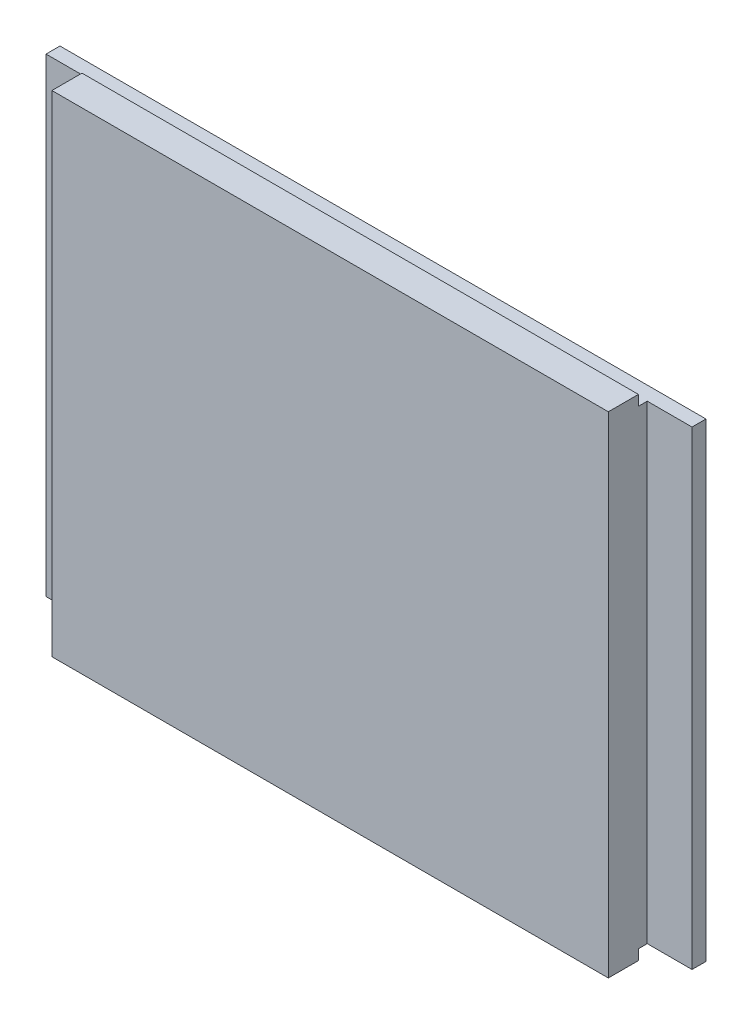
ISO-10303-21;
HEADER;
FILE_DESCRIPTION(('STEP AP214'),'2;1');
FILE_NAME('part.step','',(''),(''),'','','');
FILE_SCHEMA(('AUTOMOTIVE_DESIGN { 1 0 10303 214 1 1 1 1 }'));
ENDSEC;
DATA;
#1=APPLICATION_CONTEXT('core data for automotive mechanical design processes');
#2=APPLICATION_PROTOCOL_DEFINITION('international standard','automotive_design',2000,#1);
#3=PRODUCT_CONTEXT('',#1,'mechanical');
#4=PRODUCT('Part','Part','',(#3));
#5=PRODUCT_RELATED_PRODUCT_CATEGORY('part','',(#4));
#6=PRODUCT_DEFINITION_FORMATION('','',#4);
#7=PRODUCT_DEFINITION_CONTEXT('part definition',#1,'design');
#8=PRODUCT_DEFINITION('design','',#6,#7);
#9=PRODUCT_DEFINITION_SHAPE('','',#8);
#10=(LENGTH_UNIT() NAMED_UNIT(*) SI_UNIT(.MILLI.,.METRE.));
#11=(NAMED_UNIT(*) PLANE_ANGLE_UNIT() SI_UNIT($,.RADIAN.));
#12=(NAMED_UNIT(*) SI_UNIT($,.STERADIAN.) SOLID_ANGLE_UNIT());
#13=UNCERTAINTY_MEASURE_WITH_UNIT(LENGTH_MEASURE(1.E-05),#10,'distance_accuracy_value','');
#14=(GEOMETRIC_REPRESENTATION_CONTEXT(3) GLOBAL_UNCERTAINTY_ASSIGNED_CONTEXT((#13)) GLOBAL_UNIT_ASSIGNED_CONTEXT((#10,
#11,#12)) REPRESENTATION_CONTEXT('',''));
#15=CARTESIAN_POINT('',(0.,0.,0.));
#16=DIRECTION('',(0.,0.,1.));
#17=DIRECTION('',(1.,0.,0.));
#18=AXIS2_PLACEMENT_3D('',#15,#16,#17);
#19=CARTESIAN_POINT('',(-110.,80.,18.));
#20=DIRECTION('',(0.,-1.,0.));
#21=DIRECTION('',(0.,0.,-1.));
#22=AXIS2_PLACEMENT_3D('',#19,#20,#21);
#23=PLANE('',#22);
#24=DIRECTION('',(-1.,0.,0.));
#25=VECTOR('',#24,1.);
#26=CARTESIAN_POINT('',(-110.,80.,7.75));
#27=LINE('',#26,#25);
#28=CARTESIAN_POINT('',(94.75,80.,7.75));
#29=VERTEX_POINT('',#28);
#30=CARTESIAN_POINT('',(-94.75,80.,7.75));
#31=VERTEX_POINT('',#30);
#32=EDGE_CURVE('E59',#29,#31,#27,.T.);
#33=ORIENTED_EDGE('',*,*,#32,.F.);
#34=DIRECTION('',(0.,0.,1.));
#35=VECTOR('',#34,1.);
#36=CARTESIAN_POINT('',(94.75,80.,4.75));
#37=LINE('',#36,#35);
#38=CARTESIAN_POINT('',(94.75,80.,4.75));
#39=VERTEX_POINT('',#38);
#40=EDGE_CURVE('E204',#39,#29,#37,.T.);
#41=ORIENTED_EDGE('',*,*,#40,.F.);
#42=DIRECTION('',(-1.,0.,0.));
#43=VECTOR('',#42,1.);
#44=CARTESIAN_POINT('',(0.,80.,4.75));
#45=LINE('',#44,#43);
#46=CARTESIAN_POINT('',(110.,80.,4.75));
#47=VERTEX_POINT('',#46);
#48=EDGE_CURVE('E221',#47,#39,#45,.T.);
#49=ORIENTED_EDGE('',*,*,#48,.F.);
#50=DIRECTION('',(0.,0.,-1.));
#51=VECTOR('',#50,1.);
#52=CARTESIAN_POINT('',(110.,80.,18.));
#53=LINE('',#52,#51);
#54=CARTESIAN_POINT('',(110.,80.,0.));
#55=VERTEX_POINT('',#54);
#56=EDGE_CURVE('E11',#47,#55,#53,.T.);
#57=ORIENTED_EDGE('',*,*,#56,.T.);
#58=DIRECTION('',(-1.,0.,0.));
#59=VECTOR('',#58,1.);
#60=CARTESIAN_POINT('',(-110.,80.,0.));
#61=LINE('',#60,#59);
#62=CARTESIAN_POINT('',(-110.,80.,0.));
#63=VERTEX_POINT('',#62);
#64=EDGE_CURVE('E236',#55,#63,#61,.T.);
#65=ORIENTED_EDGE('',*,*,#64,.T.);
#66=DIRECTION('',(0.,0.,-1.));
#67=VECTOR('',#66,1.);
#68=CARTESIAN_POINT('',(-110.,80.,18.));
#69=LINE('',#68,#67);
#70=CARTESIAN_POINT('',(-110.,80.,4.75));
#71=VERTEX_POINT('',#70);
#72=EDGE_CURVE('E52',#71,#63,#69,.T.);
#73=ORIENTED_EDGE('',*,*,#72,.F.);
#74=DIRECTION('',(-1.,0.,0.));
#75=VECTOR('',#74,1.);
#76=CARTESIAN_POINT('',(0.,80.,4.75));
#77=LINE('',#76,#75);
#78=CARTESIAN_POINT('',(-94.75,80.,4.75));
#79=VERTEX_POINT('',#78);
#80=EDGE_CURVE('E192',#79,#71,#77,.T.);
#81=ORIENTED_EDGE('',*,*,#80,.F.);
#82=DIRECTION('',(0.,0.,1.));
#83=VECTOR('',#82,1.);
#84=CARTESIAN_POINT('',(-94.75,80.,4.75));
#85=LINE('',#84,#83);
#86=EDGE_CURVE('E64',#79,#31,#85,.T.);
#87=ORIENTED_EDGE('',*,*,#86,.T.);
#88=EDGE_LOOP('',(#33,#41,#49,#57,#65,#73,#81,#87));
#89=FACE_BOUND('',#88,.T.);
#90=ADVANCED_FACE('F43',(#89),#23,.F.);
#91=CARTESIAN_POINT('',(-110.,-80.,18.));
#92=DIRECTION('',(0.,1.,0.));
#93=DIRECTION('',(0.,0.,1.));
#94=AXIS2_PLACEMENT_3D('',#91,#92,#93);
#95=PLANE('',#94);
#96=DIRECTION('',(1.,0.,0.));
#97=VECTOR('',#96,1.);
#98=CARTESIAN_POINT('',(-110.,-80.,7.75));
#99=LINE('',#98,#97);
#100=CARTESIAN_POINT('',(-94.75,-80.,7.75));
#101=VERTEX_POINT('',#100);
#102=CARTESIAN_POINT('',(94.75,-80.,7.75));
#103=VERTEX_POINT('',#102);
#104=EDGE_CURVE('E180',#101,#103,#99,.T.);
#105=ORIENTED_EDGE('',*,*,#104,.F.);
#106=DIRECTION('',(0.,0.,1.));
#107=VECTOR('',#106,1.);
#108=CARTESIAN_POINT('',(-94.75,-80.,4.75));
#109=LINE('',#108,#107);
#110=CARTESIAN_POINT('',(-94.75,-80.,4.75));
#111=VERTEX_POINT('',#110);
#112=EDGE_CURVE('E205',#111,#101,#109,.T.);
#113=ORIENTED_EDGE('',*,*,#112,.F.);
#114=DIRECTION('',(1.,0.,0.));
#115=VECTOR('',#114,1.);
#116=CARTESIAN_POINT('',(0.,-80.,4.75));
#117=LINE('',#116,#115);
#118=CARTESIAN_POINT('',(-110.,-80.,4.75));
#119=VERTEX_POINT('',#118);
#120=EDGE_CURVE('E198',#119,#111,#117,.T.);
#121=ORIENTED_EDGE('',*,*,#120,.F.);
#122=DIRECTION('',(0.,0.,-1.));
#123=VECTOR('',#122,1.);
#124=CARTESIAN_POINT('',(-110.,-80.,18.));
#125=LINE('',#124,#123);
#126=CARTESIAN_POINT('',(-110.,-80.,0.));
#127=VERTEX_POINT('',#126);
#128=EDGE_CURVE('E251',#119,#127,#125,.T.);
#129=ORIENTED_EDGE('',*,*,#128,.T.);
#130=DIRECTION('',(1.,0.,0.));
#131=VECTOR('',#130,1.);
#132=CARTESIAN_POINT('',(-110.,-80.,0.));
#133=LINE('',#132,#131);
#134=CARTESIAN_POINT('',(110.,-80.,0.));
#135=VERTEX_POINT('',#134);
#136=EDGE_CURVE('E244',#127,#135,#133,.T.);
#137=ORIENTED_EDGE('',*,*,#136,.T.);
#138=DIRECTION('',(0.,0.,-1.));
#139=VECTOR('',#138,1.);
#140=CARTESIAN_POINT('',(110.,-80.,18.));
#141=LINE('',#140,#139);
#142=CARTESIAN_POINT('',(110.,-80.,4.75));
#143=VERTEX_POINT('',#142);
#144=EDGE_CURVE('E248',#143,#135,#141,.T.);
#145=ORIENTED_EDGE('',*,*,#144,.F.);
#146=DIRECTION('',(1.,0.,0.));
#147=VECTOR('',#146,1.);
#148=CARTESIAN_POINT('',(0.,-80.,4.75));
#149=LINE('',#148,#147);
#150=CARTESIAN_POINT('',(94.75,-80.,4.75));
#151=VERTEX_POINT('',#150);
#152=EDGE_CURVE('E215',#151,#143,#149,.T.);
#153=ORIENTED_EDGE('',*,*,#152,.F.);
#154=DIRECTION('',(0.,0.,1.));
#155=VECTOR('',#154,1.);
#156=CARTESIAN_POINT('',(94.75,-80.,4.75));
#157=LINE('',#156,#155);
#158=EDGE_CURVE('E225',#151,#103,#157,.T.);
#159=ORIENTED_EDGE('',*,*,#158,.T.);
#160=EDGE_LOOP('',(#105,#113,#121,#129,#137,#145,#153,#159));
#161=FACE_BOUND('',#160,.T.);
#162=ADVANCED_FACE('F270',(#161),#95,.F.);
#163=CARTESIAN_POINT('',(110.,-80.,18.));
#164=DIRECTION('',(-1.,0.,0.));
#165=DIRECTION('',(0.,0.,1.));
#166=AXIS2_PLACEMENT_3D('',#163,#164,#165);
#167=PLANE('',#166);
#168=DIRECTION('',(0.,1.,0.));
#169=VECTOR('',#168,1.);
#170=CARTESIAN_POINT('',(110.,0.,4.75));
#171=LINE('',#170,#169);
#172=EDGE_CURVE('E218',#143,#47,#171,.T.);
#173=ORIENTED_EDGE('',*,*,#172,.F.);
#174=ORIENTED_EDGE('',*,*,#144,.T.);
#175=DIRECTION('',(0.,1.,0.));
#176=VECTOR('',#175,1.);
#177=CARTESIAN_POINT('',(110.,-80.,0.));
#178=LINE('',#177,#176);
#179=EDGE_CURVE('E209',#135,#55,#178,.T.);
#180=ORIENTED_EDGE('',*,*,#179,.T.);
#181=ORIENTED_EDGE('',*,*,#56,.F.);
#182=EDGE_LOOP('',(#173,#174,#180,#181));
#183=FACE_BOUND('',#182,.T.);
#184=ADVANCED_FACE('F45',(#183),#167,.F.);
#185=CARTESIAN_POINT('',(-110.,-80.,18.));
#186=DIRECTION('',(1.,0.,0.));
#187=DIRECTION('',(0.,0.,-1.));
#188=AXIS2_PLACEMENT_3D('',#185,#186,#187);
#189=PLANE('',#188);
#190=DIRECTION('',(0.,-1.,0.));
#191=VECTOR('',#190,1.);
#192=CARTESIAN_POINT('',(-110.,0.,4.75));
#193=LINE('',#192,#191);
#194=EDGE_CURVE('E195',#71,#119,#193,.T.);
#195=ORIENTED_EDGE('',*,*,#194,.F.);
#196=ORIENTED_EDGE('',*,*,#72,.T.);
#197=DIRECTION('',(0.,-1.,0.));
#198=VECTOR('',#197,1.);
#199=CARTESIAN_POINT('',(-110.,-80.,0.));
#200=LINE('',#199,#198);
#201=EDGE_CURVE('E240',#63,#127,#200,.T.);
#202=ORIENTED_EDGE('',*,*,#201,.T.);
#203=ORIENTED_EDGE('',*,*,#128,.F.);
#204=EDGE_LOOP('',(#195,#196,#202,#203));
#205=FACE_BOUND('',#204,.T.);
#206=ADVANCED_FACE('F257',(#205),#189,.F.);
#207=CARTESIAN_POINT('',(0.,0.,18.));
#208=DIRECTION('',(0.,0.,-1.));
#209=DIRECTION('',(-1.,0.,0.));
#210=AXIS2_PLACEMENT_3D('',#207,#208,#209);
#211=PLANE('',#210);
#212=DIRECTION('',(0.,-1.,0.));
#213=VECTOR('',#212,1.);
#214=CARTESIAN_POINT('',(-94.75,0.,18.));
#215=LINE('',#214,#213);
#216=CARTESIAN_POINT('',(-94.75,83.5,18.));
#217=VERTEX_POINT('',#216);
#218=CARTESIAN_POINT('',(-94.75,-83.5,18.));
#219=VERTEX_POINT('',#218);
#220=EDGE_CURVE('E146',#217,#219,#215,.T.);
#221=ORIENTED_EDGE('',*,*,#220,.T.);
#222=DIRECTION('',(1.,0.,0.));
#223=VECTOR('',#222,1.);
#224=CARTESIAN_POINT('',(0.,-83.5,18.));
#225=LINE('',#224,#223);
#226=CARTESIAN_POINT('',(94.75,-83.5,18.));
#227=VERTEX_POINT('',#226);
#228=EDGE_CURVE('E170',#219,#227,#225,.T.);
#229=ORIENTED_EDGE('',*,*,#228,.T.);
#230=DIRECTION('',(0.,1.,0.));
#231=VECTOR('',#230,1.);
#232=CARTESIAN_POINT('',(94.75,0.,18.));
#233=LINE('',#232,#231);
#234=CARTESIAN_POINT('',(94.75,83.5,18.));
#235=VERTEX_POINT('',#234);
#236=EDGE_CURVE('E188',#227,#235,#233,.T.);
#237=ORIENTED_EDGE('',*,*,#236,.T.);
#238=DIRECTION('',(1.,0.,0.));
#239=VECTOR('',#238,1.);
#240=CARTESIAN_POINT('',(0.,83.5,18.));
#241=LINE('',#240,#239);
#242=EDGE_CURVE('E151',#217,#235,#241,.T.);
#243=ORIENTED_EDGE('',*,*,#242,.F.);
#244=EDGE_LOOP('',(#221,#229,#237,#243));
#245=FACE_BOUND('',#244,.T.);
#246=ADVANCED_FACE('F287',(#245),#211,.F.);
#247=CARTESIAN_POINT('',(0.,0.,0.));
#248=DIRECTION('',(0.,0.,-1.));
#249=DIRECTION('',(-1.,0.,0.));
#250=AXIS2_PLACEMENT_3D('',#247,#248,#249);
#251=PLANE('',#250);
#252=ORIENTED_EDGE('',*,*,#179,.F.);
#253=ORIENTED_EDGE('',*,*,#136,.F.);
#254=ORIENTED_EDGE('',*,*,#201,.F.);
#255=ORIENTED_EDGE('',*,*,#64,.F.);
#256=EDGE_LOOP('',(#252,#253,#254,#255));
#257=FACE_BOUND('',#256,.T.);
#258=ADVANCED_FACE('F266',(#257),#251,.T.);
#259=CARTESIAN_POINT('',(94.75,0.,4.75));
#260=DIRECTION('',(1.,0.,0.));
#261=DIRECTION('',(0.,0.,-1.));
#262=AXIS2_PLACEMENT_3D('',#259,#260,#261);
#263=PLANE('',#262);
#264=ORIENTED_EDGE('',*,*,#236,.F.);
#265=DIRECTION('',(0.,0.,-1.));
#266=VECTOR('',#265,1.);
#267=CARTESIAN_POINT('',(94.75,-83.5,0.));
#268=LINE('',#267,#266);
#269=CARTESIAN_POINT('',(94.75,-83.5,7.75));
#270=VERTEX_POINT('',#269);
#271=EDGE_CURVE('E140',#227,#270,#268,.T.);
#272=ORIENTED_EDGE('',*,*,#271,.T.);
#273=DIRECTION('',(0.,1.,0.));
#274=VECTOR('',#273,1.);
#275=CARTESIAN_POINT('',(94.75,-83.5,7.75));
#276=LINE('',#275,#274);
#277=EDGE_CURVE('E177',#270,#103,#276,.T.);
#278=ORIENTED_EDGE('',*,*,#277,.T.);
#279=ORIENTED_EDGE('',*,*,#158,.F.);
#280=DIRECTION('',(0.,1.,0.));
#281=VECTOR('',#280,1.);
#282=CARTESIAN_POINT('',(94.75,0.,4.75));
#283=LINE('',#282,#281);
#284=EDGE_CURVE('E212',#151,#39,#283,.T.);
#285=ORIENTED_EDGE('',*,*,#284,.T.);
#286=ORIENTED_EDGE('',*,*,#40,.T.);
#287=CARTESIAN_POINT('',(94.75,83.5,7.75));
#288=VERTEX_POINT('',#287);
#289=EDGE_CURVE('E181',#29,#288,#276,.T.);
#290=ORIENTED_EDGE('',*,*,#289,.T.);
#291=DIRECTION('',(0.,0.,-1.));
#292=VECTOR('',#291,1.);
#293=CARTESIAN_POINT('',(94.75,83.5,0.));
#294=LINE('',#293,#292);
#295=EDGE_CURVE('E156',#235,#288,#294,.T.);
#296=ORIENTED_EDGE('',*,*,#295,.F.);
#297=EDGE_LOOP('',(#264,#272,#278,#279,#285,#286,#290,#296));
#298=FACE_BOUND('',#297,.T.);
#299=ADVANCED_FACE('F289',(#298),#263,.T.);
#300=CARTESIAN_POINT('',(0.,0.,4.75));
#301=DIRECTION('',(0.,0.,1.));
#302=DIRECTION('',(1.,0.,0.));
#303=AXIS2_PLACEMENT_3D('',#300,#301,#302);
#304=PLANE('',#303);
#305=ORIENTED_EDGE('',*,*,#284,.F.);
#306=ORIENTED_EDGE('',*,*,#152,.T.);
#307=ORIENTED_EDGE('',*,*,#172,.T.);
#308=ORIENTED_EDGE('',*,*,#48,.T.);
#309=EDGE_LOOP('',(#305,#306,#307,#308));
#310=FACE_BOUND('',#309,.T.);
#311=ADVANCED_FACE('F295',(#310),#304,.T.);
#312=CARTESIAN_POINT('',(-94.75,0.,4.75));
#313=DIRECTION('',(-1.,0.,0.));
#314=DIRECTION('',(0.,-1.,0.));
#315=AXIS2_PLACEMENT_3D('',#312,#313,#314);
#316=PLANE('',#315);
#317=ORIENTED_EDGE('',*,*,#220,.F.);
#318=DIRECTION('',(0.,0.,1.));
#319=VECTOR('',#318,1.);
#320=CARTESIAN_POINT('',(-94.75,83.5,0.));
#321=LINE('',#320,#319);
#322=CARTESIAN_POINT('',(-94.75,83.5,7.75));
#323=VERTEX_POINT('',#322);
#324=EDGE_CURVE('E143',#323,#217,#321,.T.);
#325=ORIENTED_EDGE('',*,*,#324,.F.);
#326=DIRECTION('',(0.,1.,0.));
#327=VECTOR('',#326,1.);
#328=CARTESIAN_POINT('',(-94.75,-83.5,7.75));
#329=LINE('',#328,#327);
#330=EDGE_CURVE('E131',#31,#323,#329,.T.);
#331=ORIENTED_EDGE('',*,*,#330,.F.);
#332=ORIENTED_EDGE('',*,*,#86,.F.);
#333=DIRECTION('',(0.,-1.,0.));
#334=VECTOR('',#333,1.);
#335=CARTESIAN_POINT('',(-94.75,0.,4.75));
#336=LINE('',#335,#334);
#337=EDGE_CURVE('E189',#79,#111,#336,.T.);
#338=ORIENTED_EDGE('',*,*,#337,.T.);
#339=ORIENTED_EDGE('',*,*,#112,.T.);
#340=CARTESIAN_POINT('',(-94.75,-83.5,7.75));
#341=VERTEX_POINT('',#340);
#342=EDGE_CURVE('E139',#341,#101,#329,.T.);
#343=ORIENTED_EDGE('',*,*,#342,.F.);
#344=DIRECTION('',(0.,0.,1.));
#345=VECTOR('',#344,1.);
#346=CARTESIAN_POINT('',(-94.75,-83.5,0.));
#347=LINE('',#346,#345);
#348=EDGE_CURVE('E167',#341,#219,#347,.T.);
#349=ORIENTED_EDGE('',*,*,#348,.T.);
#350=EDGE_LOOP('',(#317,#325,#331,#332,#338,#339,#343,#349));
#351=FACE_BOUND('',#350,.T.);
#352=ADVANCED_FACE('F144',(#351),#316,.T.);
#353=CARTESIAN_POINT('',(0.,0.,4.75));
#354=DIRECTION('',(0.,0.,1.));
#355=DIRECTION('',(1.,0.,0.));
#356=AXIS2_PLACEMENT_3D('',#353,#354,#355);
#357=PLANE('',#356);
#358=ORIENTED_EDGE('',*,*,#337,.F.);
#359=ORIENTED_EDGE('',*,*,#80,.T.);
#360=ORIENTED_EDGE('',*,*,#194,.T.);
#361=ORIENTED_EDGE('',*,*,#120,.T.);
#362=EDGE_LOOP('',(#358,#359,#360,#361));
#363=FACE_BOUND('',#362,.T.);
#364=ADVANCED_FACE('F276',(#363),#357,.T.);
#365=CARTESIAN_POINT('',(0.,-83.5,0.));
#366=DIRECTION('',(0.,1.,0.));
#367=DIRECTION('',(0.,0.,1.));
#368=AXIS2_PLACEMENT_3D('',#365,#366,#367);
#369=PLANE('',#368);
#370=DIRECTION('',(1.,0.,0.));
#371=VECTOR('',#370,1.);
#372=CARTESIAN_POINT('',(0.,-83.5,7.75));
#373=LINE('',#372,#371);
#374=EDGE_CURVE('E164',#341,#270,#373,.T.);
#375=ORIENTED_EDGE('',*,*,#374,.T.);
#376=ORIENTED_EDGE('',*,*,#271,.F.);
#377=ORIENTED_EDGE('',*,*,#228,.F.);
#378=ORIENTED_EDGE('',*,*,#348,.F.);
#379=EDGE_LOOP('',(#375,#376,#377,#378));
#380=FACE_BOUND('',#379,.T.);
#381=ADVANCED_FACE('F285',(#380),#369,.F.);
#382=CARTESIAN_POINT('',(0.,-83.5,7.75));
#383=DIRECTION('',(0.,0.,1.));
#384=DIRECTION('',(1.,0.,0.));
#385=AXIS2_PLACEMENT_3D('',#382,#383,#384);
#386=PLANE('',#385);
#387=ORIENTED_EDGE('',*,*,#342,.T.);
#388=ORIENTED_EDGE('',*,*,#104,.T.);
#389=ORIENTED_EDGE('',*,*,#277,.F.);
#390=ORIENTED_EDGE('',*,*,#374,.F.);
#391=EDGE_LOOP('',(#387,#388,#389,#390));
#392=FACE_BOUND('',#391,.T.);
#393=ADVANCED_FACE('F281',(#392),#386,.F.);
#394=ORIENTED_EDGE('',*,*,#289,.F.);
#395=ORIENTED_EDGE('',*,*,#32,.T.);
#396=ORIENTED_EDGE('',*,*,#330,.T.);
#397=DIRECTION('',(1.,0.,0.));
#398=VECTOR('',#397,1.);
#399=CARTESIAN_POINT('',(0.,83.5,7.75));
#400=LINE('',#399,#398);
#401=EDGE_CURVE('E136',#323,#288,#400,.T.);
#402=ORIENTED_EDGE('',*,*,#401,.T.);
#403=EDGE_LOOP('',(#394,#395,#396,#402));
#404=FACE_BOUND('',#403,.T.);
#405=ADVANCED_FACE('F134',(#404),#386,.F.);
#406=CARTESIAN_POINT('',(0.,83.5,0.));
#407=DIRECTION('',(0.,1.,0.));
#408=DIRECTION('',(0.,0.,1.));
#409=AXIS2_PLACEMENT_3D('',#406,#407,#408);
#410=PLANE('',#409);
#411=ORIENTED_EDGE('',*,*,#401,.F.);
#412=ORIENTED_EDGE('',*,*,#324,.T.);
#413=ORIENTED_EDGE('',*,*,#242,.T.);
#414=ORIENTED_EDGE('',*,*,#295,.T.);
#415=EDGE_LOOP('',(#411,#412,#413,#414));
#416=FACE_BOUND('',#415,.T.);
#417=ADVANCED_FACE('F154',(#416),#410,.T.);
#418=CLOSED_SHELL('',(#90,#162,#184,#206,#246,#258,#299,#311,#352,#364,#381,#393,#405,#417));
#419=MANIFOLD_SOLID_BREP('B2',#418);
#420=ADVANCED_BREP_SHAPE_REPRESENTATION('',(#18,#419),#14);
#421=SHAPE_DEFINITION_REPRESENTATION(#9,#420);
ENDSEC;
END-ISO-10303-21;
